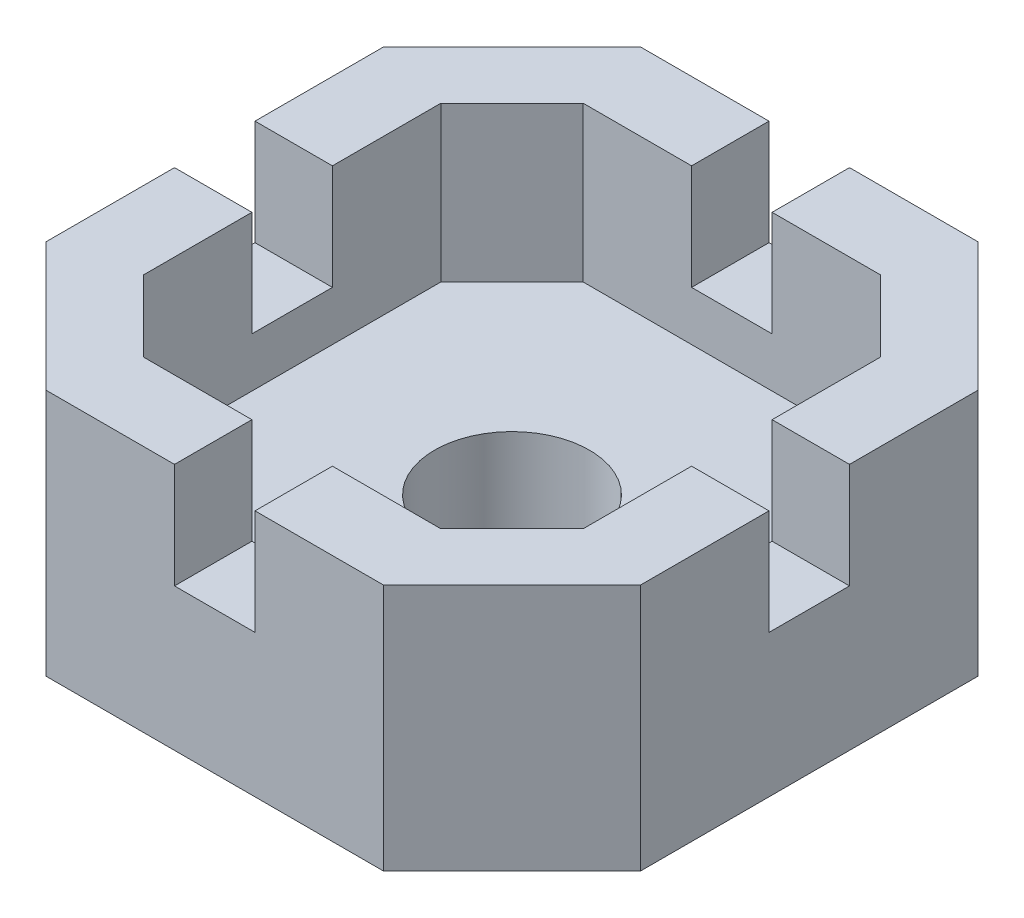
ISO-10303-21;
HEADER;
FILE_DESCRIPTION(('STEP AP214'),'2;1');
FILE_NAME('part.step','',(''),(''),'','','');
FILE_SCHEMA(('AUTOMOTIVE_DESIGN { 1 0 10303 214 1 1 1 1 }'));
ENDSEC;
DATA;
#1=APPLICATION_CONTEXT('core data for automotive mechanical design processes');
#2=APPLICATION_PROTOCOL_DEFINITION('international standard','automotive_design',2000,#1);
#3=PRODUCT_CONTEXT('',#1,'mechanical');
#4=PRODUCT('Part','Part','',(#3));
#5=PRODUCT_RELATED_PRODUCT_CATEGORY('part','',(#4));
#6=PRODUCT_DEFINITION_FORMATION('','',#4);
#7=PRODUCT_DEFINITION_CONTEXT('part definition',#1,'design');
#8=PRODUCT_DEFINITION('design','',#6,#7);
#9=PRODUCT_DEFINITION_SHAPE('','',#8);
#10=(LENGTH_UNIT() NAMED_UNIT(*) SI_UNIT(.MILLI.,.METRE.));
#11=(NAMED_UNIT(*) PLANE_ANGLE_UNIT() SI_UNIT($,.RADIAN.));
#12=(NAMED_UNIT(*) SI_UNIT($,.STERADIAN.) SOLID_ANGLE_UNIT());
#13=UNCERTAINTY_MEASURE_WITH_UNIT(LENGTH_MEASURE(1.E-05),#10,'distance_accuracy_value','');
#14=(GEOMETRIC_REPRESENTATION_CONTEXT(3) GLOBAL_UNCERTAINTY_ASSIGNED_CONTEXT((#13)) GLOBAL_UNIT_ASSIGNED_CONTEXT((#10,
#11,#12)) REPRESENTATION_CONTEXT('',''));
#15=CARTESIAN_POINT('',(0.,0.,0.));
#16=DIRECTION('',(0.,0.,1.));
#17=DIRECTION('',(1.,0.,0.));
#18=AXIS2_PLACEMENT_3D('',#15,#16,#17);
#19=CARTESIAN_POINT('',(0.,6.35,0.));
#20=DIRECTION('',(0.,1.,0.));
#21=DIRECTION('',(0.,0.,1.));
#22=AXIS2_PLACEMENT_3D('',#19,#20,#21);
#23=PLANE('',#22);
#24=DIRECTION('',(1.,0.,0.));
#25=VECTOR('',#24,1.);
#26=CARTESIAN_POINT('',(-12.192,6.35,12.1919999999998));
#27=LINE('',#26,#25);
#28=CARTESIAN_POINT('',(1.651,6.35,12.1919999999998));
#29=VERTEX_POINT('',#28);
#30=CARTESIAN_POINT('',(6.9215,6.35,12.1919999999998));
#31=VERTEX_POINT('',#30);
#32=EDGE_CURVE('E346',#29,#31,#27,.T.);
#33=ORIENTED_EDGE('',*,*,#32,.T.);
#34=DIRECTION('',(0.70710678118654,0.,-0.707106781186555));
#35=VECTOR('',#34,1.);
#36=CARTESIAN_POINT('',(9.55674999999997,6.35,9.55674999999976));
#37=LINE('',#36,#35);
#38=CARTESIAN_POINT('',(12.192,6.35,6.92149999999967));
#39=VERTEX_POINT('',#38);
#40=EDGE_CURVE('E262',#31,#39,#37,.T.);
#41=ORIENTED_EDGE('',*,*,#40,.T.);
#42=DIRECTION('',(0.,0.,-1.));
#43=VECTOR('',#42,1.);
#44=CARTESIAN_POINT('',(12.192,6.35,12.1919999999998));
#45=LINE('',#44,#43);
#46=CARTESIAN_POINT('',(12.192,6.35,1.651));
#47=VERTEX_POINT('',#46);
#48=EDGE_CURVE('E349',#39,#47,#45,.T.);
#49=ORIENTED_EDGE('',*,*,#48,.T.);
#50=DIRECTION('',(-1.,0.,0.));
#51=VECTOR('',#50,1.);
#52=CARTESIAN_POINT('',(0.,6.35,1.651));
#53=LINE('',#52,#51);
#54=CARTESIAN_POINT('',(9.017,6.35,1.651));
#55=VERTEX_POINT('',#54);
#56=EDGE_CURVE('E439',#47,#55,#53,.T.);
#57=ORIENTED_EDGE('',*,*,#56,.T.);
#58=DIRECTION('',(0.,0.,-1.));
#59=VECTOR('',#58,1.);
#60=CARTESIAN_POINT('',(9.017,6.35,-6.096));
#61=LINE('',#60,#59);
#62=CARTESIAN_POINT('',(9.017,6.35,6.096));
#63=VERTEX_POINT('',#62);
#64=EDGE_CURVE('E297',#63,#55,#61,.T.);
#65=ORIENTED_EDGE('',*,*,#64,.F.);
#66=DIRECTION('',(0.70710678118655,0.,-0.707106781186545));
#67=VECTOR('',#66,1.);
#68=CARTESIAN_POINT('',(9.017,6.35,6.096));
#69=LINE('',#68,#67);
#70=CARTESIAN_POINT('',(6.096,6.35,9.01699999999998));
#71=VERTEX_POINT('',#70);
#72=EDGE_CURVE('E294',#71,#63,#69,.T.);
#73=ORIENTED_EDGE('',*,*,#72,.F.);
#74=DIRECTION('',(1.,0.,0.));
#75=VECTOR('',#74,1.);
#76=CARTESIAN_POINT('',(6.096,6.35,9.01699999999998));
#77=LINE('',#76,#75);
#78=CARTESIAN_POINT('',(1.651,6.35,9.0169999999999));
#79=VERTEX_POINT('',#78);
#80=EDGE_CURVE('E290',#79,#71,#77,.T.);
#81=ORIENTED_EDGE('',*,*,#80,.F.);
#82=DIRECTION('',(0.,0.,1.));
#83=VECTOR('',#82,1.);
#84=CARTESIAN_POINT('',(1.651,6.35,0.));
#85=LINE('',#84,#83);
#86=EDGE_CURVE('E403',#79,#29,#85,.T.);
#87=ORIENTED_EDGE('',*,*,#86,.T.);
#88=EDGE_LOOP('',(#33,#41,#49,#57,#65,#73,#81,#87));
#89=FACE_BOUND('',#88,.T.);
#90=ADVANCED_FACE('F39',(#89),#23,.T.);
#91=DIRECTION('',(0.,0.,1.));
#92=VECTOR('',#91,1.);
#93=CARTESIAN_POINT('',(-12.192,6.35,-12.1919999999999));
#94=LINE('',#93,#92);
#95=CARTESIAN_POINT('',(-12.192,6.35,1.651));
#96=VERTEX_POINT('',#95);
#97=CARTESIAN_POINT('',(-12.192,6.35,6.92149999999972));
#98=VERTEX_POINT('',#97);
#99=EDGE_CURVE('E47',#96,#98,#94,.T.);
#100=ORIENTED_EDGE('',*,*,#99,.T.);
#101=DIRECTION('',(0.707106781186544,0.,0.707106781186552));
#102=VECTOR('',#101,1.);
#103=CARTESIAN_POINT('',(-9.55674999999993,6.35,9.55674999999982));
#104=LINE('',#103,#102);
#105=CARTESIAN_POINT('',(-6.92149999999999,6.35,12.1919999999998));
#106=VERTEX_POINT('',#105);
#107=EDGE_CURVE('E253',#98,#106,#104,.T.);
#108=ORIENTED_EDGE('',*,*,#107,.T.);
#109=CARTESIAN_POINT('',(-1.651,6.35,12.1919999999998));
#110=VERTEX_POINT('',#109);
#111=EDGE_CURVE('E261',#106,#110,#27,.T.);
#112=ORIENTED_EDGE('',*,*,#111,.T.);
#113=DIRECTION('',(0.,0.,1.));
#114=VECTOR('',#113,1.);
#115=CARTESIAN_POINT('',(-1.651,6.35,0.));
#116=LINE('',#115,#114);
#117=CARTESIAN_POINT('',(-1.651,6.35,9.01699999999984));
#118=VERTEX_POINT('',#117);
#119=EDGE_CURVE('E412',#118,#110,#116,.T.);
#120=ORIENTED_EDGE('',*,*,#119,.F.);
#121=CARTESIAN_POINT('',(-6.0960000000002,6.35,9.01699999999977));
#122=VERTEX_POINT('',#121);
#123=EDGE_CURVE('E291',#122,#118,#77,.T.);
#124=ORIENTED_EDGE('',*,*,#123,.F.);
#125=DIRECTION('',(0.707106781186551,0.,0.707106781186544));
#126=VECTOR('',#125,1.);
#127=CARTESIAN_POINT('',(-6.0960000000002,6.35,9.01699999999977));
#128=LINE('',#127,#126);
#129=CARTESIAN_POINT('',(-9.017,6.35,6.096));
#130=VERTEX_POINT('',#129);
#131=EDGE_CURVE('E288',#130,#122,#128,.T.);
#132=ORIENTED_EDGE('',*,*,#131,.F.);
#133=DIRECTION('',(0.,0.,1.));
#134=VECTOR('',#133,1.);
#135=CARTESIAN_POINT('',(-9.017,6.35,6.096));
#136=LINE('',#135,#134);
#137=CARTESIAN_POINT('',(-9.017,6.35,1.651));
#138=VERTEX_POINT('',#137);
#139=EDGE_CURVE('E283',#138,#130,#136,.T.);
#140=ORIENTED_EDGE('',*,*,#139,.F.);
#141=DIRECTION('',(-1.,0.,0.));
#142=VECTOR('',#141,1.);
#143=CARTESIAN_POINT('',(0.,6.35,1.651));
#144=LINE('',#143,#142);
#145=EDGE_CURVE('E465',#138,#96,#144,.T.);
#146=ORIENTED_EDGE('',*,*,#145,.T.);
#147=EDGE_LOOP('',(#100,#108,#112,#120,#124,#132,#140,#146));
#148=FACE_BOUND('',#147,.T.);
#149=ADVANCED_FACE('F524',(#148),#23,.T.);
#150=CARTESIAN_POINT('',(12.192,6.35,-1.651));
#151=VERTEX_POINT('',#150);
#152=CARTESIAN_POINT('',(12.192,6.35,-6.92149999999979));
#153=VERTEX_POINT('',#152);
#154=EDGE_CURVE('E348',#151,#153,#45,.T.);
#155=ORIENTED_EDGE('',*,*,#154,.T.);
#156=DIRECTION('',(-0.707106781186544,0.,-0.707106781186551));
#157=VECTOR('',#156,1.);
#158=CARTESIAN_POINT('',(9.55674999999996,6.35,-9.55674999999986));
#159=LINE('',#158,#157);
#160=CARTESIAN_POINT('',(6.92150000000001,6.35,-12.1919999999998));
#161=VERTEX_POINT('',#160);
#162=EDGE_CURVE('E386',#153,#161,#159,.T.);
#163=ORIENTED_EDGE('',*,*,#162,.T.);
#164=DIRECTION('',(-1.,0.,0.));
#165=VECTOR('',#164,1.);
#166=CARTESIAN_POINT('',(12.192,6.35,-12.1919999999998));
#167=LINE('',#166,#165);
#168=CARTESIAN_POINT('',(1.651,6.35,-12.1919999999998));
#169=VERTEX_POINT('',#168);
#170=EDGE_CURVE('E351',#161,#169,#167,.T.);
#171=ORIENTED_EDGE('',*,*,#170,.T.);
#172=DIRECTION('',(0.,0.,1.));
#173=VECTOR('',#172,1.);
#174=CARTESIAN_POINT('',(1.651,6.35,0.));
#175=LINE('',#174,#173);
#176=CARTESIAN_POINT('',(1.651,6.35,-9.01699999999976));
#177=VERTEX_POINT('',#176);
#178=EDGE_CURVE('E483',#169,#177,#175,.T.);
#179=ORIENTED_EDGE('',*,*,#178,.T.);
#180=DIRECTION('',(-1.,0.,0.));
#181=VECTOR('',#180,1.);
#182=CARTESIAN_POINT('',(-6.0960000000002,6.35,-9.01699999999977));
#183=LINE('',#182,#181);
#184=CARTESIAN_POINT('',(6.096,6.35,-9.01699999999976));
#185=VERTEX_POINT('',#184);
#186=EDGE_CURVE('E304',#185,#177,#183,.T.);
#187=ORIENTED_EDGE('',*,*,#186,.F.);
#188=DIRECTION('',(-0.707106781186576,0.,-0.707106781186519));
#189=VECTOR('',#188,1.);
#190=CARTESIAN_POINT('',(6.096,6.35,-9.01699999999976));
#191=LINE('',#190,#189);
#192=CARTESIAN_POINT('',(9.017,6.35,-6.096));
#193=VERTEX_POINT('',#192);
#194=EDGE_CURVE('E300',#193,#185,#191,.T.);
#195=ORIENTED_EDGE('',*,*,#194,.F.);
#196=CARTESIAN_POINT('',(9.017,6.35,-1.651));
#197=VERTEX_POINT('',#196);
#198=EDGE_CURVE('E296',#197,#193,#61,.T.);
#199=ORIENTED_EDGE('',*,*,#198,.F.);
#200=DIRECTION('',(-1.,0.,0.));
#201=VECTOR('',#200,1.);
#202=CARTESIAN_POINT('',(0.,6.35,-1.651));
#203=LINE('',#202,#201);
#204=EDGE_CURVE('E430',#151,#197,#203,.T.);
#205=ORIENTED_EDGE('',*,*,#204,.F.);
#206=EDGE_LOOP('',(#155,#163,#171,#179,#187,#195,#199,#205));
#207=FACE_BOUND('',#206,.T.);
#208=ADVANCED_FACE('F530',(#207),#23,.T.);
#209=CARTESIAN_POINT('',(-1.651,6.35,-12.1919999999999));
#210=VERTEX_POINT('',#209);
#211=CARTESIAN_POINT('',(-6.9215,6.35,-12.1919999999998));
#212=VERTEX_POINT('',#211);
#213=EDGE_CURVE('E350',#210,#212,#167,.T.);
#214=ORIENTED_EDGE('',*,*,#213,.T.);
#215=DIRECTION('',(-0.707106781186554,0.,0.707106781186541));
#216=VECTOR('',#215,1.);
#217=CARTESIAN_POINT('',(-9.55674999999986,6.35,-9.55675000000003));
#218=LINE('',#217,#216);
#219=CARTESIAN_POINT('',(-12.192,6.35,-6.92149999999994));
#220=VERTEX_POINT('',#219);
#221=EDGE_CURVE('E364',#212,#220,#218,.T.);
#222=ORIENTED_EDGE('',*,*,#221,.T.);
#223=CARTESIAN_POINT('',(-12.192,6.35,-1.651));
#224=VERTEX_POINT('',#223);
#225=EDGE_CURVE('E11',#220,#224,#94,.T.);
#226=ORIENTED_EDGE('',*,*,#225,.T.);
#227=DIRECTION('',(-1.,0.,0.));
#228=VECTOR('',#227,1.);
#229=CARTESIAN_POINT('',(0.,6.35,-1.651));
#230=LINE('',#229,#228);
#231=CARTESIAN_POINT('',(-9.017,6.35,-1.651));
#232=VERTEX_POINT('',#231);
#233=EDGE_CURVE('E455',#232,#224,#230,.T.);
#234=ORIENTED_EDGE('',*,*,#233,.F.);
#235=CARTESIAN_POINT('',(-9.017,6.35,-6.096));
#236=VERTEX_POINT('',#235);
#237=EDGE_CURVE('E285',#236,#232,#136,.T.);
#238=ORIENTED_EDGE('',*,*,#237,.F.);
#239=DIRECTION('',(-0.707106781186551,0.,0.707106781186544));
#240=VECTOR('',#239,1.);
#241=CARTESIAN_POINT('',(-9.017,6.35,-6.096));
#242=LINE('',#241,#240);
#243=CARTESIAN_POINT('',(-6.0960000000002,6.35,-9.01699999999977));
#244=VERTEX_POINT('',#243);
#245=EDGE_CURVE('E281',#244,#236,#242,.T.);
#246=ORIENTED_EDGE('',*,*,#245,.F.);
#247=CARTESIAN_POINT('',(-1.651,6.35,-9.01699999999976));
#248=VERTEX_POINT('',#247);
#249=EDGE_CURVE('E303',#248,#244,#183,.T.);
#250=ORIENTED_EDGE('',*,*,#249,.F.);
#251=DIRECTION('',(0.,0.,1.));
#252=VECTOR('',#251,1.);
#253=CARTESIAN_POINT('',(-1.651,6.35,0.));
#254=LINE('',#253,#252);
#255=EDGE_CURVE('E367',#210,#248,#254,.T.);
#256=ORIENTED_EDGE('',*,*,#255,.F.);
#257=EDGE_LOOP('',(#214,#222,#226,#234,#238,#246,#250,#256));
#258=FACE_BOUND('',#257,.T.);
#259=ADVANCED_FACE('F363',(#258),#23,.T.);
#260=CARTESIAN_POINT('',(-12.192,6.35,12.1919999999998));
#261=DIRECTION('',(0.,0.,-1.));
#262=DIRECTION('',(-1.,0.,0.));
#263=AXIS2_PLACEMENT_3D('',#260,#261,#262);
#264=PLANE('',#263);
#265=DIRECTION('',(0.,1.,0.));
#266=VECTOR('',#265,1.);
#267=CARTESIAN_POINT('',(-6.92149999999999,-3.81,12.1919999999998));
#268=LINE('',#267,#266);
#269=CARTESIAN_POINT('',(-6.92149999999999,-3.81,12.1919999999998));
#270=VERTEX_POINT('',#269);
#271=EDGE_CURVE('E247',#270,#106,#268,.T.);
#272=ORIENTED_EDGE('',*,*,#271,.F.);
#273=DIRECTION('',(-1.,0.,0.));
#274=VECTOR('',#273,1.);
#275=CARTESIAN_POINT('',(12.192,-3.81,12.1919999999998));
#276=LINE('',#275,#274);
#277=CARTESIAN_POINT('',(6.9215,-3.81,12.1919999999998));
#278=VERTEX_POINT('',#277);
#279=EDGE_CURVE('E259',#278,#270,#276,.T.);
#280=ORIENTED_EDGE('',*,*,#279,.F.);
#281=DIRECTION('',(0.,1.,0.));
#282=VECTOR('',#281,1.);
#283=CARTESIAN_POINT('',(6.9215,-3.81,12.1919999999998));
#284=LINE('',#283,#282);
#285=EDGE_CURVE('E396',#278,#31,#284,.T.);
#286=ORIENTED_EDGE('',*,*,#285,.T.);
#287=ORIENTED_EDGE('',*,*,#32,.F.);
#288=DIRECTION('',(0.,1.,0.));
#289=VECTOR('',#288,1.);
#290=CARTESIAN_POINT('',(1.651,2.032,12.1919999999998));
#291=LINE('',#290,#289);
#292=CARTESIAN_POINT('',(1.651,2.032,12.1919999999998));
#293=VERTEX_POINT('',#292);
#294=EDGE_CURVE('E422',#293,#29,#291,.T.);
#295=ORIENTED_EDGE('',*,*,#294,.F.);
#296=DIRECTION('',(1.,0.,0.));
#297=VECTOR('',#296,1.);
#298=CARTESIAN_POINT('',(0.,2.032,12.1919999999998));
#299=LINE('',#298,#297);
#300=CARTESIAN_POINT('',(-1.651,2.032,12.1919999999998));
#301=VERTEX_POINT('',#300);
#302=EDGE_CURVE('E406',#301,#293,#299,.T.);
#303=ORIENTED_EDGE('',*,*,#302,.F.);
#304=DIRECTION('',(0.,1.,0.));
#305=VECTOR('',#304,1.);
#306=CARTESIAN_POINT('',(-1.651,2.032,12.1919999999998));
#307=LINE('',#306,#305);
#308=EDGE_CURVE('E424',#301,#110,#307,.T.);
#309=ORIENTED_EDGE('',*,*,#308,.T.);
#310=ORIENTED_EDGE('',*,*,#111,.F.);
#311=EDGE_LOOP('',(#272,#280,#286,#287,#295,#303,#309,#310));
#312=FACE_BOUND('',#311,.T.);
#313=ADVANCED_FACE('F41',(#312),#264,.F.);
#314=CARTESIAN_POINT('',(12.192,6.35,12.1919999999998));
#315=DIRECTION('',(-1.,0.,0.));
#316=DIRECTION('',(0.,0.,1.));
#317=AXIS2_PLACEMENT_3D('',#314,#315,#316);
#318=PLANE('',#317);
#319=DIRECTION('',(0.,1.,0.));
#320=VECTOR('',#319,1.);
#321=CARTESIAN_POINT('',(12.192,-3.81,-6.92149999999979));
#322=LINE('',#321,#320);
#323=CARTESIAN_POINT('',(12.192,-3.81,-6.92149999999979));
#324=VERTEX_POINT('',#323);
#325=EDGE_CURVE('E388',#324,#153,#322,.T.);
#326=ORIENTED_EDGE('',*,*,#325,.T.);
#327=ORIENTED_EDGE('',*,*,#154,.F.);
#328=DIRECTION('',(0.,1.,0.));
#329=VECTOR('',#328,1.);
#330=CARTESIAN_POINT('',(12.192,2.032,-1.651));
#331=LINE('',#330,#329);
#332=CARTESIAN_POINT('',(12.192,2.032,-1.651));
#333=VERTEX_POINT('',#332);
#334=EDGE_CURVE('E448',#333,#151,#331,.T.);
#335=ORIENTED_EDGE('',*,*,#334,.F.);
#336=DIRECTION('',(0.,0.,-1.));
#337=VECTOR('',#336,1.);
#338=CARTESIAN_POINT('',(12.192,2.032,0.));
#339=LINE('',#338,#337);
#340=CARTESIAN_POINT('',(12.192,2.032,1.651));
#341=VERTEX_POINT('',#340);
#342=EDGE_CURVE('E429',#341,#333,#339,.T.);
#343=ORIENTED_EDGE('',*,*,#342,.F.);
#344=DIRECTION('',(0.,1.,0.));
#345=VECTOR('',#344,1.);
#346=CARTESIAN_POINT('',(12.192,2.032,1.651));
#347=LINE('',#346,#345);
#348=EDGE_CURVE('E438',#341,#47,#347,.T.);
#349=ORIENTED_EDGE('',*,*,#348,.T.);
#350=ORIENTED_EDGE('',*,*,#48,.F.);
#351=DIRECTION('',(0.,1.,0.));
#352=VECTOR('',#351,1.);
#353=CARTESIAN_POINT('',(12.192,-3.81,6.92149999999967));
#354=LINE('',#353,#352);
#355=CARTESIAN_POINT('',(12.192,-3.81,6.92149999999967));
#356=VERTEX_POINT('',#355);
#357=EDGE_CURVE('E393',#356,#39,#354,.T.);
#358=ORIENTED_EDGE('',*,*,#357,.F.);
#359=DIRECTION('',(0.,0.,1.));
#360=VECTOR('',#359,1.);
#361=CARTESIAN_POINT('',(12.192,-3.81,12.1919999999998));
#362=LINE('',#361,#360);
#363=EDGE_CURVE('E270',#324,#356,#362,.T.);
#364=ORIENTED_EDGE('',*,*,#363,.F.);
#365=EDGE_LOOP('',(#326,#327,#335,#343,#349,#350,#358,#364));
#366=FACE_BOUND('',#365,.T.);
#367=ADVANCED_FACE('F540',(#366),#318,.F.);
#368=CARTESIAN_POINT('',(12.192,6.35,-12.1919999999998));
#369=DIRECTION('',(0.,0.,1.));
#370=DIRECTION('',(1.,0.,0.));
#371=AXIS2_PLACEMENT_3D('',#368,#369,#370);
#372=PLANE('',#371);
#373=DIRECTION('',(0.,1.,0.));
#374=VECTOR('',#373,1.);
#375=CARTESIAN_POINT('',(6.92150000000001,-3.81,-12.1919999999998));
#376=LINE('',#375,#374);
#377=CARTESIAN_POINT('',(6.92150000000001,-3.81,-12.1919999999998));
#378=VERTEX_POINT('',#377);
#379=EDGE_CURVE('E385',#378,#161,#376,.T.);
#380=ORIENTED_EDGE('',*,*,#379,.F.);
#381=DIRECTION('',(1.,0.,0.));
#382=VECTOR('',#381,1.);
#383=CARTESIAN_POINT('',(12.192,-3.81,-12.1919999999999));
#384=LINE('',#383,#382);
#385=CARTESIAN_POINT('',(-6.92149999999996,-3.81,-12.1919999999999));
#386=VERTEX_POINT('',#385);
#387=EDGE_CURVE('E272',#386,#378,#384,.T.);
#388=ORIENTED_EDGE('',*,*,#387,.F.);
#389=DIRECTION('',(0.,1.,0.));
#390=VECTOR('',#389,1.);
#391=CARTESIAN_POINT('',(-6.9215,-3.81,-12.1919999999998));
#392=LINE('',#391,#390);
#393=EDGE_CURVE('E54',#386,#212,#392,.T.);
#394=ORIENTED_EDGE('',*,*,#393,.T.);
#395=ORIENTED_EDGE('',*,*,#213,.F.);
#396=DIRECTION('',(0.,1.,0.));
#397=VECTOR('',#396,1.);
#398=CARTESIAN_POINT('',(-1.651,2.032,-12.1919999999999));
#399=LINE('',#398,#397);
#400=CARTESIAN_POINT('',(-1.651,2.032,-12.1919999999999));
#401=VERTEX_POINT('',#400);
#402=EDGE_CURVE('E373',#401,#210,#399,.T.);
#403=ORIENTED_EDGE('',*,*,#402,.F.);
#404=DIRECTION('',(-1.,0.,0.));
#405=VECTOR('',#404,1.);
#406=CARTESIAN_POINT('',(0.,2.032,-12.1919999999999));
#407=LINE('',#406,#405);
#408=CARTESIAN_POINT('',(1.651,2.032,-12.1919999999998));
#409=VERTEX_POINT('',#408);
#410=EDGE_CURVE('E479',#409,#401,#407,.T.);
#411=ORIENTED_EDGE('',*,*,#410,.F.);
#412=DIRECTION('',(0.,1.,0.));
#413=VECTOR('',#412,1.);
#414=CARTESIAN_POINT('',(1.651,2.032,-12.1919999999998));
#415=LINE('',#414,#413);
#416=EDGE_CURVE('E468',#409,#169,#415,.T.);
#417=ORIENTED_EDGE('',*,*,#416,.T.);
#418=ORIENTED_EDGE('',*,*,#170,.F.);
#419=EDGE_LOOP('',(#380,#388,#394,#395,#403,#411,#417,#418));
#420=FACE_BOUND('',#419,.T.);
#421=ADVANCED_FACE('F371',(#420),#372,.F.);
#422=CARTESIAN_POINT('',(-12.192,6.35,-12.1919999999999));
#423=DIRECTION('',(1.,0.,0.));
#424=DIRECTION('',(0.,0.,-1.));
#425=AXIS2_PLACEMENT_3D('',#422,#423,#424);
#426=PLANE('',#425);
#427=DIRECTION('',(0.,1.,0.));
#428=VECTOR('',#427,1.);
#429=CARTESIAN_POINT('',(-12.192,-3.81,-6.92149999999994));
#430=LINE('',#429,#428);
#431=CARTESIAN_POINT('',(-12.192,-3.81,-6.92149999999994));
#432=VERTEX_POINT('',#431);
#433=EDGE_CURVE('E375',#432,#220,#430,.T.);
#434=ORIENTED_EDGE('',*,*,#433,.F.);
#435=DIRECTION('',(0.,0.,-1.));
#436=VECTOR('',#435,1.);
#437=CARTESIAN_POINT('',(-12.192,-3.81,12.1919999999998));
#438=LINE('',#437,#436);
#439=CARTESIAN_POINT('',(-12.192,-3.81,6.92149999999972));
#440=VERTEX_POINT('',#439);
#441=EDGE_CURVE('E269',#440,#432,#438,.T.);
#442=ORIENTED_EDGE('',*,*,#441,.F.);
#443=DIRECTION('',(0.,1.,0.));
#444=VECTOR('',#443,1.);
#445=CARTESIAN_POINT('',(-12.192,-3.81,6.92149999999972));
#446=LINE('',#445,#444);
#447=EDGE_CURVE('E62',#440,#98,#446,.T.);
#448=ORIENTED_EDGE('',*,*,#447,.T.);
#449=ORIENTED_EDGE('',*,*,#99,.F.);
#450=DIRECTION('',(0.,1.,0.));
#451=VECTOR('',#450,1.);
#452=CARTESIAN_POINT('',(-12.192,2.032,1.651));
#453=LINE('',#452,#451);
#454=CARTESIAN_POINT('',(-12.192,2.032,1.651));
#455=VERTEX_POINT('',#454);
#456=EDGE_CURVE('E442',#455,#96,#453,.T.);
#457=ORIENTED_EDGE('',*,*,#456,.F.);
#458=DIRECTION('',(0.,0.,1.));
#459=VECTOR('',#458,1.);
#460=CARTESIAN_POINT('',(-12.192,2.032,0.));
#461=LINE('',#460,#459);
#462=CARTESIAN_POINT('',(-12.192,2.032,-1.651));
#463=VERTEX_POINT('',#462);
#464=EDGE_CURVE('E461',#463,#455,#461,.T.);
#465=ORIENTED_EDGE('',*,*,#464,.F.);
#466=DIRECTION('',(0.,1.,0.));
#467=VECTOR('',#466,1.);
#468=CARTESIAN_POINT('',(-12.192,2.032,-1.651));
#469=LINE('',#468,#467);
#470=EDGE_CURVE('E472',#463,#224,#469,.T.);
#471=ORIENTED_EDGE('',*,*,#470,.T.);
#472=ORIENTED_EDGE('',*,*,#225,.F.);
#473=EDGE_LOOP('',(#434,#442,#448,#449,#457,#465,#471,#472));
#474=FACE_BOUND('',#473,.T.);
#475=ADVANCED_FACE('F558',(#474),#426,.F.);
#476=CARTESIAN_POINT('',(0.,-3.81,0.));
#477=DIRECTION('',(0.,1.,0.));
#478=DIRECTION('',(0.,0.,1.));
#479=AXIS2_PLACEMENT_3D('',#476,#477,#478);
#480=PLANE('',#479);
#481=CARTESIAN_POINT('',(0.,-3.81,0.));
#482=DIRECTION('',(0.,-1.,0.));
#483=DIRECTION('',(0.,0.,-1.));
#484=AXIS2_PLACEMENT_3D('',#481,#482,#483);
#485=CIRCLE('',#484,3.175);
#486=CARTESIAN_POINT('',(0.,-3.81,3.17499999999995));
#487=VERTEX_POINT('',#486);
#488=EDGE_CURVE('E274',#487,#487,#485,.T.);
#489=ORIENTED_EDGE('',*,*,#488,.F.);
#490=EDGE_LOOP('',(#489));
#491=FACE_BOUND('',#490,.T.);
#492=DIRECTION('',(-0.707106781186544,0.,-0.707106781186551));
#493=VECTOR('',#492,1.);
#494=CARTESIAN_POINT('',(9.55674999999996,-3.81,-9.55674999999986));
#495=LINE('',#494,#493);
#496=EDGE_CURVE('E383',#324,#378,#495,.T.);
#497=ORIENTED_EDGE('',*,*,#496,.F.);
#498=ORIENTED_EDGE('',*,*,#363,.T.);
#499=DIRECTION('',(0.70710678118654,0.,-0.707106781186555));
#500=VECTOR('',#499,1.);
#501=CARTESIAN_POINT('',(9.55674999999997,-3.81,9.55674999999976));
#502=LINE('',#501,#500);
#503=EDGE_CURVE('E268',#278,#356,#502,.T.);
#504=ORIENTED_EDGE('',*,*,#503,.F.);
#505=ORIENTED_EDGE('',*,*,#279,.T.);
#506=DIRECTION('',(0.707106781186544,0.,0.707106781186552));
#507=VECTOR('',#506,1.);
#508=CARTESIAN_POINT('',(-9.55674999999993,-3.81,9.55674999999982));
#509=LINE('',#508,#507);
#510=EDGE_CURVE('E244',#440,#270,#509,.T.);
#511=ORIENTED_EDGE('',*,*,#510,.F.);
#512=ORIENTED_EDGE('',*,*,#441,.T.);
#513=DIRECTION('',(-0.707106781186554,0.,0.707106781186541));
#514=VECTOR('',#513,1.);
#515=CARTESIAN_POINT('',(-9.55674999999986,-3.81,-9.55675000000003));
#516=LINE('',#515,#514);
#517=EDGE_CURVE('E378',#386,#432,#516,.T.);
#518=ORIENTED_EDGE('',*,*,#517,.F.);
#519=ORIENTED_EDGE('',*,*,#387,.T.);
#520=EDGE_LOOP('',(#497,#498,#504,#505,#511,#512,#518,#519));
#521=FACE_BOUND('',#520,.T.);
#522=ADVANCED_FACE('F266',(#491,#521),#480,.F.);
#523=CARTESIAN_POINT('',(-9.017,6.35,6.096));
#524=DIRECTION('',(1.,0.,0.));
#525=DIRECTION('',(0.,0.,-1.));
#526=AXIS2_PLACEMENT_3D('',#523,#524,#525);
#527=PLANE('',#526);
#528=DIRECTION('',(0.,0.,-1.));
#529=VECTOR('',#528,1.);
#530=CARTESIAN_POINT('',(-9.017,2.032,0.));
#531=LINE('',#530,#529);
#532=CARTESIAN_POINT('',(-9.017,2.032,1.651));
#533=VERTEX_POINT('',#532);
#534=CARTESIAN_POINT('',(-9.017,2.032,-1.651));
#535=VERTEX_POINT('',#534);
#536=EDGE_CURVE('E454',#533,#535,#531,.T.);
#537=ORIENTED_EDGE('',*,*,#536,.F.);
#538=DIRECTION('',(0.,1.,0.));
#539=VECTOR('',#538,1.);
#540=CARTESIAN_POINT('',(-9.017,2.032,1.651));
#541=LINE('',#540,#539);
#542=EDGE_CURVE('E464',#533,#138,#541,.T.);
#543=ORIENTED_EDGE('',*,*,#542,.T.);
#544=ORIENTED_EDGE('',*,*,#139,.T.);
#545=DIRECTION('',(0.,-1.,0.));
#546=VECTOR('',#545,1.);
#547=CARTESIAN_POINT('',(-9.017,6.35,6.096));
#548=LINE('',#547,#546);
#549=CARTESIAN_POINT('',(-9.017,0.,6.096));
#550=VERTEX_POINT('',#549);
#551=EDGE_CURVE('E341',#130,#550,#548,.T.);
#552=ORIENTED_EDGE('',*,*,#551,.T.);
#553=DIRECTION('',(0.,0.,1.));
#554=VECTOR('',#553,1.);
#555=CARTESIAN_POINT('',(-9.017,0.,6.096));
#556=LINE('',#555,#554);
#557=CARTESIAN_POINT('',(-9.017,0.,-6.096));
#558=VERTEX_POINT('',#557);
#559=EDGE_CURVE('E310',#558,#550,#556,.T.);
#560=ORIENTED_EDGE('',*,*,#559,.F.);
#561=DIRECTION('',(0.,-1.,0.));
#562=VECTOR('',#561,1.);
#563=CARTESIAN_POINT('',(-9.017,6.35,-6.096));
#564=LINE('',#563,#562);
#565=EDGE_CURVE('E343',#236,#558,#564,.T.);
#566=ORIENTED_EDGE('',*,*,#565,.F.);
#567=ORIENTED_EDGE('',*,*,#237,.T.);
#568=DIRECTION('',(0.,1.,0.));
#569=VECTOR('',#568,1.);
#570=CARTESIAN_POINT('',(-9.017,2.032,-1.651));
#571=LINE('',#570,#569);
#572=EDGE_CURVE('E475',#535,#232,#571,.T.);
#573=ORIENTED_EDGE('',*,*,#572,.F.);
#574=EDGE_LOOP('',(#537,#543,#544,#552,#560,#566,#567,#573));
#575=FACE_BOUND('',#574,.T.);
#576=ADVANCED_FACE('F567',(#575),#527,.T.);
#577=CARTESIAN_POINT('',(6.096,6.35,9.01699999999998));
#578=DIRECTION('',(0.,0.,-1.));
#579=DIRECTION('',(-1.,0.,0.));
#580=AXIS2_PLACEMENT_3D('',#577,#578,#579);
#581=PLANE('',#580);
#582=DIRECTION('',(-1.,0.,0.));
#583=VECTOR('',#582,1.);
#584=CARTESIAN_POINT('',(-1.53956708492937E-13,2.032,9.01699999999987));
#585=LINE('',#584,#583);
#586=CARTESIAN_POINT('',(1.651,2.032,9.0169999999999));
#587=VERTEX_POINT('',#586);
#588=CARTESIAN_POINT('',(-1.651,2.032,9.01699999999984));
#589=VERTEX_POINT('',#588);
#590=EDGE_CURVE('E399',#587,#589,#585,.T.);
#591=ORIENTED_EDGE('',*,*,#590,.F.);
#592=DIRECTION('',(0.,1.,0.));
#593=VECTOR('',#592,1.);
#594=CARTESIAN_POINT('',(1.651,2.032,9.0169999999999));
#595=LINE('',#594,#593);
#596=EDGE_CURVE('E418',#587,#79,#595,.T.);
#597=ORIENTED_EDGE('',*,*,#596,.T.);
#598=ORIENTED_EDGE('',*,*,#80,.T.);
#599=DIRECTION('',(0.,-1.,0.));
#600=VECTOR('',#599,1.);
#601=CARTESIAN_POINT('',(6.096,6.35,9.01699999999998));
#602=LINE('',#601,#600);
#603=CARTESIAN_POINT('',(6.096,0.,9.01699999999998));
#604=VERTEX_POINT('',#603);
#605=EDGE_CURVE('E337',#71,#604,#602,.T.);
#606=ORIENTED_EDGE('',*,*,#605,.T.);
#607=DIRECTION('',(1.,0.,0.));
#608=VECTOR('',#607,1.);
#609=CARTESIAN_POINT('',(6.096,0.,9.01699999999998));
#610=LINE('',#609,#608);
#611=CARTESIAN_POINT('',(-6.0960000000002,0.,9.01699999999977));
#612=VERTEX_POINT('',#611);
#613=EDGE_CURVE('E316',#612,#604,#610,.T.);
#614=ORIENTED_EDGE('',*,*,#613,.F.);
#615=DIRECTION('',(0.,-1.,0.));
#616=VECTOR('',#615,1.);
#617=CARTESIAN_POINT('',(-6.0960000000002,6.35,9.01699999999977));
#618=LINE('',#617,#616);
#619=EDGE_CURVE('E339',#122,#612,#618,.T.);
#620=ORIENTED_EDGE('',*,*,#619,.F.);
#621=ORIENTED_EDGE('',*,*,#123,.T.);
#622=DIRECTION('',(0.,1.,0.));
#623=VECTOR('',#622,1.);
#624=CARTESIAN_POINT('',(-1.651,2.032,9.01699999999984));
#625=LINE('',#624,#623);
#626=EDGE_CURVE('E411',#589,#118,#625,.T.);
#627=ORIENTED_EDGE('',*,*,#626,.F.);
#628=EDGE_LOOP('',(#591,#597,#598,#606,#614,#620,#621,#627));
#629=FACE_BOUND('',#628,.T.);
#630=ADVANCED_FACE('F624',(#629),#581,.T.);
#631=CARTESIAN_POINT('',(9.017,6.35,-6.096));
#632=DIRECTION('',(-1.,0.,0.));
#633=DIRECTION('',(0.,0.,1.));
#634=AXIS2_PLACEMENT_3D('',#631,#632,#633);
#635=PLANE('',#634);
#636=ORIENTED_EDGE('',*,*,#64,.T.);
#637=DIRECTION('',(0.,1.,0.));
#638=VECTOR('',#637,1.);
#639=CARTESIAN_POINT('',(9.017,2.032,1.651));
#640=LINE('',#639,#638);
#641=CARTESIAN_POINT('',(9.017,2.032,1.651));
#642=VERTEX_POINT('',#641);
#643=EDGE_CURVE('E415',#642,#55,#640,.T.);
#644=ORIENTED_EDGE('',*,*,#643,.F.);
#645=DIRECTION('',(0.,0.,1.));
#646=VECTOR('',#645,1.);
#647=CARTESIAN_POINT('',(9.017,2.032,0.));
#648=LINE('',#647,#646);
#649=CARTESIAN_POINT('',(9.017,2.032,-1.651));
#650=VERTEX_POINT('',#649);
#651=EDGE_CURVE('E435',#650,#642,#648,.T.);
#652=ORIENTED_EDGE('',*,*,#651,.F.);
#653=DIRECTION('',(0.,1.,0.));
#654=VECTOR('',#653,1.);
#655=CARTESIAN_POINT('',(9.017,2.032,-1.651));
#656=LINE('',#655,#654);
#657=EDGE_CURVE('E445',#650,#197,#656,.T.);
#658=ORIENTED_EDGE('',*,*,#657,.T.);
#659=ORIENTED_EDGE('',*,*,#198,.T.);
#660=DIRECTION('',(0.,-1.,0.));
#661=VECTOR('',#660,1.);
#662=CARTESIAN_POINT('',(9.017,6.35,-6.096));
#663=LINE('',#662,#661);
#664=CARTESIAN_POINT('',(9.017,0.,-6.096));
#665=VERTEX_POINT('',#664);
#666=EDGE_CURVE('E333',#193,#665,#663,.T.);
#667=ORIENTED_EDGE('',*,*,#666,.T.);
#668=DIRECTION('',(0.,0.,-1.));
#669=VECTOR('',#668,1.);
#670=CARTESIAN_POINT('',(9.017,0.,-6.096));
#671=LINE('',#670,#669);
#672=CARTESIAN_POINT('',(9.017,0.,6.096));
#673=VERTEX_POINT('',#672);
#674=EDGE_CURVE('E322',#673,#665,#671,.T.);
#675=ORIENTED_EDGE('',*,*,#674,.F.);
#676=DIRECTION('',(0.,-1.,0.));
#677=VECTOR('',#676,1.);
#678=CARTESIAN_POINT('',(9.017,6.35,6.096));
#679=LINE('',#678,#677);
#680=EDGE_CURVE('E335',#63,#673,#679,.T.);
#681=ORIENTED_EDGE('',*,*,#680,.F.);
#682=EDGE_LOOP('',(#636,#644,#652,#658,#659,#667,#675,#681));
#683=FACE_BOUND('',#682,.T.);
#684=ADVANCED_FACE('F600',(#683),#635,.T.);
#685=CARTESIAN_POINT('',(-6.0960000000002,6.35,-9.01699999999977));
#686=DIRECTION('',(0.,0.,1.));
#687=DIRECTION('',(1.,0.,0.));
#688=AXIS2_PLACEMENT_3D('',#685,#686,#687);
#689=PLANE('',#688);
#690=ORIENTED_EDGE('',*,*,#186,.T.);
#691=DIRECTION('',(0.,1.,0.));
#692=VECTOR('',#691,1.);
#693=CARTESIAN_POINT('',(1.651,2.032,-9.01699999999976));
#694=LINE('',#693,#692);
#695=CARTESIAN_POINT('',(1.651,2.032,-9.01699999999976));
#696=VERTEX_POINT('',#695);
#697=EDGE_CURVE('E494',#696,#177,#694,.T.);
#698=ORIENTED_EDGE('',*,*,#697,.F.);
#699=DIRECTION('',(1.,0.,0.));
#700=VECTOR('',#699,1.);
#701=CARTESIAN_POINT('',(0.,2.032,-9.01699999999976));
#702=LINE('',#701,#700);
#703=CARTESIAN_POINT('',(-1.651,2.032,-9.01699999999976));
#704=VERTEX_POINT('',#703);
#705=EDGE_CURVE('E485',#704,#696,#702,.T.);
#706=ORIENTED_EDGE('',*,*,#705,.F.);
#707=DIRECTION('',(0.,1.,0.));
#708=VECTOR('',#707,1.);
#709=CARTESIAN_POINT('',(-1.651,2.032,-9.01699999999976));
#710=LINE('',#709,#708);
#711=EDGE_CURVE('E496',#704,#248,#710,.T.);
#712=ORIENTED_EDGE('',*,*,#711,.T.);
#713=ORIENTED_EDGE('',*,*,#249,.T.);
#714=DIRECTION('',(0.,-1.,0.));
#715=VECTOR('',#714,1.);
#716=CARTESIAN_POINT('',(-6.0960000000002,6.35,-9.01699999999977));
#717=LINE('',#716,#715);
#718=CARTESIAN_POINT('',(-6.0960000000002,0.,-9.01699999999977));
#719=VERTEX_POINT('',#718);
#720=EDGE_CURVE('E307',#244,#719,#717,.T.);
#721=ORIENTED_EDGE('',*,*,#720,.T.);
#722=DIRECTION('',(-1.,0.,0.));
#723=VECTOR('',#722,1.);
#724=CARTESIAN_POINT('',(-6.0960000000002,0.,-9.01699999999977));
#725=LINE('',#724,#723);
#726=CARTESIAN_POINT('',(6.096,0.,-9.01699999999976));
#727=VERTEX_POINT('',#726);
#728=EDGE_CURVE('E284',#727,#719,#725,.T.);
#729=ORIENTED_EDGE('',*,*,#728,.F.);
#730=DIRECTION('',(0.,-1.,0.));
#731=VECTOR('',#730,1.);
#732=CARTESIAN_POINT('',(6.096,6.35,-9.01699999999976));
#733=LINE('',#732,#731);
#734=EDGE_CURVE('E331',#185,#727,#733,.T.);
#735=ORIENTED_EDGE('',*,*,#734,.F.);
#736=EDGE_LOOP('',(#690,#698,#706,#712,#713,#721,#729,#735));
#737=FACE_BOUND('',#736,.T.);
#738=ADVANCED_FACE('F586',(#737),#689,.T.);
#739=CARTESIAN_POINT('',(-9.017,6.35,-6.096));
#740=DIRECTION('',(0.707106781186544,0.,0.707106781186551));
#741=DIRECTION('',(0.707106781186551,0.,-0.707106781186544));
#742=AXIS2_PLACEMENT_3D('',#739,#740,#741);
#743=PLANE('',#742);
#744=DIRECTION('',(-0.707106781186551,0.,0.707106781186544));
#745=VECTOR('',#744,1.);
#746=CARTESIAN_POINT('',(-9.017,0.,-6.096));
#747=LINE('',#746,#745);
#748=EDGE_CURVE('E280',#719,#558,#747,.T.);
#749=ORIENTED_EDGE('',*,*,#748,.F.);
#750=ORIENTED_EDGE('',*,*,#720,.F.);
#751=ORIENTED_EDGE('',*,*,#245,.T.);
#752=ORIENTED_EDGE('',*,*,#565,.T.);
#753=EDGE_LOOP('',(#749,#750,#751,#752));
#754=FACE_BOUND('',#753,.T.);
#755=ADVANCED_FACE('F581',(#754),#743,.T.);
#756=CARTESIAN_POINT('',(-6.0960000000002,6.35,9.01699999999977));
#757=DIRECTION('',(0.707106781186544,0.,-0.707106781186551));
#758=DIRECTION('',(-0.707106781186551,0.,-0.707106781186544));
#759=AXIS2_PLACEMENT_3D('',#756,#757,#758);
#760=PLANE('',#759);
#761=DIRECTION('',(0.707106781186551,0.,0.707106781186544));
#762=VECTOR('',#761,1.);
#763=CARTESIAN_POINT('',(-6.0960000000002,0.,9.01699999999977));
#764=LINE('',#763,#762);
#765=EDGE_CURVE('E313',#550,#612,#764,.T.);
#766=ORIENTED_EDGE('',*,*,#765,.F.);
#767=ORIENTED_EDGE('',*,*,#551,.F.);
#768=ORIENTED_EDGE('',*,*,#131,.T.);
#769=ORIENTED_EDGE('',*,*,#619,.T.);
#770=EDGE_LOOP('',(#766,#767,#768,#769));
#771=FACE_BOUND('',#770,.T.);
#772=ADVANCED_FACE('F826',(#771),#760,.T.);
#773=CARTESIAN_POINT('',(9.017,6.35,6.096));
#774=DIRECTION('',(-0.707106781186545,0.,-0.70710678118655));
#775=DIRECTION('',(-0.70710678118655,0.,0.707106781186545));
#776=AXIS2_PLACEMENT_3D('',#773,#774,#775);
#777=PLANE('',#776);
#778=DIRECTION('',(0.70710678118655,0.,-0.707106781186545));
#779=VECTOR('',#778,1.);
#780=CARTESIAN_POINT('',(9.017,0.,6.096));
#781=LINE('',#780,#779);
#782=EDGE_CURVE('E319',#604,#673,#781,.T.);
#783=ORIENTED_EDGE('',*,*,#782,.F.);
#784=ORIENTED_EDGE('',*,*,#605,.F.);
#785=ORIENTED_EDGE('',*,*,#72,.T.);
#786=ORIENTED_EDGE('',*,*,#680,.T.);
#787=EDGE_LOOP('',(#783,#784,#785,#786));
#788=FACE_BOUND('',#787,.T.);
#789=ADVANCED_FACE('F618',(#788),#777,.T.);
#790=CARTESIAN_POINT('',(6.096,6.35,-9.01699999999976));
#791=DIRECTION('',(-0.707106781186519,0.,0.707106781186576));
#792=DIRECTION('',(0.707106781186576,0.,0.707106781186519));
#793=AXIS2_PLACEMENT_3D('',#790,#791,#792);
#794=PLANE('',#793);
#795=DIRECTION('',(-0.707106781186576,0.,-0.707106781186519));
#796=VECTOR('',#795,1.);
#797=CARTESIAN_POINT('',(6.096,0.,-9.01699999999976));
#798=LINE('',#797,#796);
#799=EDGE_CURVE('E325',#665,#727,#798,.T.);
#800=ORIENTED_EDGE('',*,*,#799,.F.);
#801=ORIENTED_EDGE('',*,*,#666,.F.);
#802=ORIENTED_EDGE('',*,*,#194,.T.);
#803=ORIENTED_EDGE('',*,*,#734,.T.);
#804=EDGE_LOOP('',(#800,#801,#802,#803));
#805=FACE_BOUND('',#804,.T.);
#806=ADVANCED_FACE('F518',(#805),#794,.T.);
#807=CARTESIAN_POINT('',(0.,0.,0.));
#808=DIRECTION('',(0.,1.,0.));
#809=DIRECTION('',(0.,0.,1.));
#810=AXIS2_PLACEMENT_3D('',#807,#808,#809);
#811=PLANE('',#810);
#812=ORIENTED_EDGE('',*,*,#728,.T.);
#813=ORIENTED_EDGE('',*,*,#748,.T.);
#814=ORIENTED_EDGE('',*,*,#559,.T.);
#815=ORIENTED_EDGE('',*,*,#765,.T.);
#816=ORIENTED_EDGE('',*,*,#613,.T.);
#817=ORIENTED_EDGE('',*,*,#782,.T.);
#818=ORIENTED_EDGE('',*,*,#674,.T.);
#819=ORIENTED_EDGE('',*,*,#799,.T.);
#820=EDGE_LOOP('',(#812,#813,#814,#815,#816,#817,#818,#819));
#821=FACE_BOUND('',#820,.T.);
#822=CARTESIAN_POINT('',(0.,0.,0.));
#823=DIRECTION('',(0.,-1.,0.));
#824=DIRECTION('',(0.,0.,-1.));
#825=AXIS2_PLACEMENT_3D('',#822,#823,#824);
#826=CIRCLE('',#825,3.175);
#827=CARTESIAN_POINT('',(0.,0.,3.17499999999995));
#828=VERTEX_POINT('',#827);
#829=EDGE_CURVE('E421',#828,#828,#826,.T.);
#830=ORIENTED_EDGE('',*,*,#829,.T.);
#831=EDGE_LOOP('',(#830));
#832=FACE_BOUND('',#831,.T.);
#833=ADVANCED_FACE('F504',(#821,#832),#811,.T.);
#834=CARTESIAN_POINT('',(0.,-3.81,0.));
#835=DIRECTION('',(0.,1.,0.));
#836=DIRECTION('',(0.,0.,1.));
#837=AXIS2_PLACEMENT_3D('',#834,#835,#836);
#838=CYLINDRICAL_SURFACE('',#837,3.175);
#839=CARTESIAN_POINT('',(0.,-3.81,3.17499999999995));
#840=CARTESIAN_POINT('',(0.,-3.7703125,3.17499999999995));
#841=CARTESIAN_POINT('',(0.,-3.730625,3.17499999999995));
#842=CARTESIAN_POINT('',(0.,-3.65125,3.17499999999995));
#843=CARTESIAN_POINT('',(0.,-3.6115625,3.17499999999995));
#844=CARTESIAN_POINT('',(0.,-3.5321875,3.17499999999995));
#845=CARTESIAN_POINT('',(0.,-3.4925,3.17499999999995));
#846=CARTESIAN_POINT('',(0.,-3.413125,3.17499999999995));
#847=CARTESIAN_POINT('',(0.,-3.3734375,3.17499999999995));
#848=CARTESIAN_POINT('',(0.,-3.2940625,3.17499999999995));
#849=CARTESIAN_POINT('',(0.,-3.254375,3.17499999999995));
#850=CARTESIAN_POINT('',(0.,-3.175,3.17499999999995));
#851=CARTESIAN_POINT('',(0.,-3.1353125,3.17499999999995));
#852=CARTESIAN_POINT('',(0.,-3.0559375,3.17499999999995));
#853=CARTESIAN_POINT('',(0.,-3.01625,3.17499999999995));
#854=CARTESIAN_POINT('',(0.,-2.936875,3.17499999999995));
#855=CARTESIAN_POINT('',(0.,-2.8971875,3.17499999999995));
#856=CARTESIAN_POINT('',(0.,-2.8178125,3.17499999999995));
#857=CARTESIAN_POINT('',(0.,-2.778125,3.17499999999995));
#858=CARTESIAN_POINT('',(0.,-2.69875,3.17499999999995));
#859=CARTESIAN_POINT('',(0.,-2.6590625,3.17499999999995));
#860=CARTESIAN_POINT('',(0.,-2.5796875,3.17499999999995));
#861=CARTESIAN_POINT('',(0.,-2.54,3.17499999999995));
#862=CARTESIAN_POINT('',(0.,-2.460625,3.17499999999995));
#863=CARTESIAN_POINT('',(0.,-2.4209375,3.17499999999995));
#864=CARTESIAN_POINT('',(0.,-2.3415625,3.17499999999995));
#865=CARTESIAN_POINT('',(0.,-2.301875,3.17499999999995));
#866=CARTESIAN_POINT('',(0.,-2.2225,3.17499999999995));
#867=CARTESIAN_POINT('',(0.,-2.1828125,3.17499999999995));
#868=CARTESIAN_POINT('',(0.,-2.1034375,3.17499999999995));
#869=CARTESIAN_POINT('',(0.,-2.06375,3.17499999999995));
#870=CARTESIAN_POINT('',(0.,-1.984375,3.17499999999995));
#871=CARTESIAN_POINT('',(0.,-1.9446875,3.17499999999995));
#872=CARTESIAN_POINT('',(0.,-1.8653125,3.17499999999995));
#873=CARTESIAN_POINT('',(0.,-1.825625,3.17499999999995));
#874=CARTESIAN_POINT('',(0.,-1.74625,3.17499999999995));
#875=CARTESIAN_POINT('',(0.,-1.7065625,3.17499999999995));
#876=CARTESIAN_POINT('',(0.,-1.6271875,3.17499999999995));
#877=CARTESIAN_POINT('',(0.,-1.5875,3.17499999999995));
#878=CARTESIAN_POINT('',(0.,-1.508125,3.17499999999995));
#879=CARTESIAN_POINT('',(0.,-1.4684375,3.17499999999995));
#880=CARTESIAN_POINT('',(0.,-1.3890625,3.17499999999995));
#881=CARTESIAN_POINT('',(0.,-1.349375,3.17499999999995));
#882=CARTESIAN_POINT('',(0.,-1.27,3.17499999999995));
#883=CARTESIAN_POINT('',(0.,-1.2303125,3.17499999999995));
#884=CARTESIAN_POINT('',(0.,-1.1509375,3.17499999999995));
#885=CARTESIAN_POINT('',(0.,-1.11125,3.17499999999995));
#886=CARTESIAN_POINT('',(0.,-1.031875,3.17499999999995));
#887=CARTESIAN_POINT('',(0.,-0.9921875,3.17499999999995));
#888=CARTESIAN_POINT('',(0.,-0.9128125,3.17499999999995));
#889=CARTESIAN_POINT('',(0.,-0.873125,3.17499999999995));
#890=CARTESIAN_POINT('',(0.,-0.79375,3.17499999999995));
#891=CARTESIAN_POINT('',(0.,-0.7540625,3.17499999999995));
#892=CARTESIAN_POINT('',(0.,-0.6746875,3.17499999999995));
#893=CARTESIAN_POINT('',(0.,-0.635,3.17499999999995));
#894=CARTESIAN_POINT('',(0.,-0.555625,3.17499999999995));
#895=CARTESIAN_POINT('',(0.,-0.5159375,3.17499999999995));
#896=CARTESIAN_POINT('',(0.,-0.4365625,3.17499999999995));
#897=CARTESIAN_POINT('',(0.,-0.396875,3.17499999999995));
#898=CARTESIAN_POINT('',(0.,-0.3175,3.17499999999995));
#899=CARTESIAN_POINT('',(0.,-0.2778125,3.17499999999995));
#900=CARTESIAN_POINT('',(0.,-0.1984375,3.17499999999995));
#901=CARTESIAN_POINT('',(0.,-0.15875,3.17499999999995));
#902=CARTESIAN_POINT('',(0.,-0.0793749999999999,3.17499999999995));
#903=CARTESIAN_POINT('',(0.,-0.0396874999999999,3.17499999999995));
#904=CARTESIAN_POINT('',(0.,0.,3.17499999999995));
#905=B_SPLINE_CURVE_WITH_KNOTS('',3,(#839,#840,#841,#842,#843,#844,#845,#846,#847,#848,#849,
#850,#851,#852,#853,#854,#855,#856,#857,#858,#859,#860,#861,#862,#863,#864,#865,#866,#867,#868,
#869,#870,#871,#872,#873,#874,#875,#876,#877,#878,#879,#880,#881,#882,#883,#884,#885,#886,#887,
#888,#889,#890,#891,#892,#893,#894,#895,#896,#897,#898,#899,#900,#901,#902,#903,#904),
.UNSPECIFIED.,.F.,.F.,(4,2,2,2,2,2,2,2,2,2,2,2,2,2,2,2,2,2,2,2,2,2,2,2,2,2,2,2,2,2,2,2,4),(0.,
0.1190625,0.238125,0.3571875,0.47625,0.595312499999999,0.714375,0.833437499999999,
0.952499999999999,1.0715625,1.190625,1.3096875,1.42875,1.5478125,1.666875,1.7859375,1.905,
2.0240625,2.143125,2.2621875,2.38125,2.5003125,2.619375,2.7384375,2.8575,2.9765625,3.095625,
3.2146875,3.33375,3.4528125,3.571875,3.6909375,3.81),.UNSPECIFIED.);
#906=EDGE_CURVE('BSEAM506',#487,#828,#905,.T.);
#907=ORIENTED_EDGE('',*,*,#488,.T.);
#908=ORIENTED_EDGE('',*,*,#829,.F.);
#909=ORIENTED_EDGE('',*,*,#906,.T.);
#910=ORIENTED_EDGE('',*,*,#906,.F.);
#911=EDGE_LOOP('',(#907,#909,#908,#910));
#912=FACE_BOUND('',#911,.T.);
#913=ADVANCED_FACE('F506',(#912),#838,.F.);
#914=CARTESIAN_POINT('',(1.651,2.032,0.));
#915=DIRECTION('',(-1.,0.,0.));
#916=DIRECTION('',(0.,0.,1.));
#917=AXIS2_PLACEMENT_3D('',#914,#915,#916);
#918=PLANE('',#917);
#919=ORIENTED_EDGE('',*,*,#178,.F.);
#920=ORIENTED_EDGE('',*,*,#416,.F.);
#921=DIRECTION('',(0.,0.,1.));
#922=VECTOR('',#921,1.);
#923=CARTESIAN_POINT('',(1.651,2.032,0.));
#924=LINE('',#923,#922);
#925=EDGE_CURVE('E488',#409,#696,#924,.T.);
#926=ORIENTED_EDGE('',*,*,#925,.T.);
#927=ORIENTED_EDGE('',*,*,#697,.T.);
#928=EDGE_LOOP('',(#919,#920,#926,#927));
#929=FACE_BOUND('',#928,.T.);
#930=ADVANCED_FACE('F508',(#929),#918,.T.);
#931=CARTESIAN_POINT('',(-1.651,2.032,0.));
#932=DIRECTION('',(-1.,0.,0.));
#933=DIRECTION('',(0.,0.,1.));
#934=AXIS2_PLACEMENT_3D('',#931,#932,#933);
#935=PLANE('',#934);
#936=ORIENTED_EDGE('',*,*,#255,.T.);
#937=ORIENTED_EDGE('',*,*,#711,.F.);
#938=DIRECTION('',(0.,0.,1.));
#939=VECTOR('',#938,1.);
#940=CARTESIAN_POINT('',(-1.651,2.032,0.));
#941=LINE('',#940,#939);
#942=EDGE_CURVE('E482',#401,#704,#941,.T.);
#943=ORIENTED_EDGE('',*,*,#942,.F.);
#944=ORIENTED_EDGE('',*,*,#402,.T.);
#945=EDGE_LOOP('',(#936,#937,#943,#944));
#946=FACE_BOUND('',#945,.T.);
#947=ADVANCED_FACE('F515',(#946),#935,.F.);
#948=CARTESIAN_POINT('',(0.,2.032,0.));
#949=DIRECTION('',(0.,1.,0.));
#950=DIRECTION('',(0.,0.,1.));
#951=AXIS2_PLACEMENT_3D('',#948,#949,#950);
#952=PLANE('',#951);
#953=ORIENTED_EDGE('',*,*,#410,.T.);
#954=ORIENTED_EDGE('',*,*,#942,.T.);
#955=ORIENTED_EDGE('',*,*,#705,.T.);
#956=ORIENTED_EDGE('',*,*,#925,.F.);
#957=EDGE_LOOP('',(#953,#954,#955,#956));
#958=FACE_BOUND('',#957,.T.);
#959=ADVANCED_FACE('F593',(#958),#952,.T.);
#960=CARTESIAN_POINT('',(0.,2.032,1.651));
#961=DIRECTION('',(0.,0.,-1.));
#962=DIRECTION('',(-1.,0.,0.));
#963=AXIS2_PLACEMENT_3D('',#960,#961,#962);
#964=PLANE('',#963);
#965=ORIENTED_EDGE('',*,*,#56,.F.);
#966=ORIENTED_EDGE('',*,*,#348,.F.);
#967=DIRECTION('',(-1.,0.,0.));
#968=VECTOR('',#967,1.);
#969=CARTESIAN_POINT('',(0.,2.032,1.651));
#970=LINE('',#969,#968);
#971=EDGE_CURVE('E427',#341,#642,#970,.T.);
#972=ORIENTED_EDGE('',*,*,#971,.T.);
#973=ORIENTED_EDGE('',*,*,#643,.T.);
#974=EDGE_LOOP('',(#965,#966,#972,#973));
#975=FACE_BOUND('',#974,.T.);
#976=ADVANCED_FACE('F613',(#975),#964,.T.);
#977=CARTESIAN_POINT('',(0.,2.032,-1.651));
#978=DIRECTION('',(0.,0.,-1.));
#979=DIRECTION('',(-1.,0.,0.));
#980=AXIS2_PLACEMENT_3D('',#977,#978,#979);
#981=PLANE('',#980);
#982=ORIENTED_EDGE('',*,*,#204,.T.);
#983=ORIENTED_EDGE('',*,*,#657,.F.);
#984=DIRECTION('',(-1.,0.,0.));
#985=VECTOR('',#984,1.);
#986=CARTESIAN_POINT('',(0.,2.032,-1.651));
#987=LINE('',#986,#985);
#988=EDGE_CURVE('E433',#333,#650,#987,.T.);
#989=ORIENTED_EDGE('',*,*,#988,.F.);
#990=ORIENTED_EDGE('',*,*,#334,.T.);
#991=EDGE_LOOP('',(#982,#983,#989,#990));
#992=FACE_BOUND('',#991,.T.);
#993=ADVANCED_FACE('F606',(#992),#981,.F.);
#994=CARTESIAN_POINT('',(0.,2.032,0.));
#995=DIRECTION('',(0.,1.,0.));
#996=DIRECTION('',(0.,0.,1.));
#997=AXIS2_PLACEMENT_3D('',#994,#995,#996);
#998=PLANE('',#997);
#999=ORIENTED_EDGE('',*,*,#971,.F.);
#1000=ORIENTED_EDGE('',*,*,#342,.T.);
#1001=ORIENTED_EDGE('',*,*,#988,.T.);
#1002=ORIENTED_EDGE('',*,*,#651,.T.);
#1003=EDGE_LOOP('',(#999,#1000,#1001,#1002));
#1004=FACE_BOUND('',#1003,.T.);
#1005=ADVANCED_FACE('F609',(#1004),#998,.T.);
#1006=CARTESIAN_POINT('',(1.651,2.032,0.));
#1007=DIRECTION('',(-1.,0.,0.));
#1008=DIRECTION('',(0.,0.,1.));
#1009=AXIS2_PLACEMENT_3D('',#1006,#1007,#1008);
#1010=PLANE('',#1009);
#1011=ORIENTED_EDGE('',*,*,#86,.F.);
#1012=ORIENTED_EDGE('',*,*,#596,.F.);
#1013=DIRECTION('',(0.,0.,1.));
#1014=VECTOR('',#1013,1.);
#1015=CARTESIAN_POINT('',(1.651,2.032,0.));
#1016=LINE('',#1015,#1014);
#1017=EDGE_CURVE('E409',#587,#293,#1016,.T.);
#1018=ORIENTED_EDGE('',*,*,#1017,.T.);
#1019=ORIENTED_EDGE('',*,*,#294,.T.);
#1020=EDGE_LOOP('',(#1011,#1012,#1018,#1019));
#1021=FACE_BOUND('',#1020,.T.);
#1022=ADVANCED_FACE('F629',(#1021),#1010,.T.);
#1023=CARTESIAN_POINT('',(-1.651,2.032,0.));
#1024=DIRECTION('',(-1.,0.,0.));
#1025=DIRECTION('',(0.,0.,1.));
#1026=AXIS2_PLACEMENT_3D('',#1023,#1024,#1025);
#1027=PLANE('',#1026);
#1028=ORIENTED_EDGE('',*,*,#119,.T.);
#1029=ORIENTED_EDGE('',*,*,#308,.F.);
#1030=DIRECTION('',(0.,0.,1.));
#1031=VECTOR('',#1030,1.);
#1032=CARTESIAN_POINT('',(-1.651,2.032,0.));
#1033=LINE('',#1032,#1031);
#1034=EDGE_CURVE('E402',#589,#301,#1033,.T.);
#1035=ORIENTED_EDGE('',*,*,#1034,.F.);
#1036=ORIENTED_EDGE('',*,*,#626,.T.);
#1037=EDGE_LOOP('',(#1028,#1029,#1035,#1036));
#1038=FACE_BOUND('',#1037,.T.);
#1039=ADVANCED_FACE('F649',(#1038),#1027,.F.);
#1040=CARTESIAN_POINT('',(0.,2.032,0.));
#1041=DIRECTION('',(0.,1.,0.));
#1042=DIRECTION('',(0.,0.,1.));
#1043=AXIS2_PLACEMENT_3D('',#1040,#1041,#1042);
#1044=PLANE('',#1043);
#1045=ORIENTED_EDGE('',*,*,#590,.T.);
#1046=ORIENTED_EDGE('',*,*,#1034,.T.);
#1047=ORIENTED_EDGE('',*,*,#302,.T.);
#1048=ORIENTED_EDGE('',*,*,#1017,.F.);
#1049=EDGE_LOOP('',(#1045,#1046,#1047,#1048));
#1050=FACE_BOUND('',#1049,.T.);
#1051=ADVANCED_FACE('F646',(#1050),#1044,.T.);
#1052=CARTESIAN_POINT('',(0.,2.032,1.651));
#1053=DIRECTION('',(0.,0.,-1.));
#1054=DIRECTION('',(-1.,0.,0.));
#1055=AXIS2_PLACEMENT_3D('',#1052,#1053,#1054);
#1056=PLANE('',#1055);
#1057=ORIENTED_EDGE('',*,*,#145,.F.);
#1058=ORIENTED_EDGE('',*,*,#542,.F.);
#1059=DIRECTION('',(-1.,0.,0.));
#1060=VECTOR('',#1059,1.);
#1061=CARTESIAN_POINT('',(0.,2.032,1.651));
#1062=LINE('',#1061,#1060);
#1063=EDGE_CURVE('E452',#533,#455,#1062,.T.);
#1064=ORIENTED_EDGE('',*,*,#1063,.T.);
#1065=ORIENTED_EDGE('',*,*,#456,.T.);
#1066=EDGE_LOOP('',(#1057,#1058,#1064,#1065));
#1067=FACE_BOUND('',#1066,.T.);
#1068=ADVANCED_FACE('F564',(#1067),#1056,.T.);
#1069=CARTESIAN_POINT('',(0.,2.032,-1.651));
#1070=DIRECTION('',(0.,0.,-1.));
#1071=DIRECTION('',(-1.,0.,0.));
#1072=AXIS2_PLACEMENT_3D('',#1069,#1070,#1071);
#1073=PLANE('',#1072);
#1074=ORIENTED_EDGE('',*,*,#233,.T.);
#1075=ORIENTED_EDGE('',*,*,#470,.F.);
#1076=DIRECTION('',(-1.,0.,0.));
#1077=VECTOR('',#1076,1.);
#1078=CARTESIAN_POINT('',(0.,2.032,-1.651));
#1079=LINE('',#1078,#1077);
#1080=EDGE_CURVE('E458',#535,#463,#1079,.T.);
#1081=ORIENTED_EDGE('',*,*,#1080,.F.);
#1082=ORIENTED_EDGE('',*,*,#572,.T.);
#1083=EDGE_LOOP('',(#1074,#1075,#1081,#1082));
#1084=FACE_BOUND('',#1083,.T.);
#1085=ADVANCED_FACE('F574',(#1084),#1073,.F.);
#1086=CARTESIAN_POINT('',(0.,2.032,0.));
#1087=DIRECTION('',(0.,1.,0.));
#1088=DIRECTION('',(0.,0.,1.));
#1089=AXIS2_PLACEMENT_3D('',#1086,#1087,#1088);
#1090=PLANE('',#1089);
#1091=ORIENTED_EDGE('',*,*,#1063,.F.);
#1092=ORIENTED_EDGE('',*,*,#536,.T.);
#1093=ORIENTED_EDGE('',*,*,#1080,.T.);
#1094=ORIENTED_EDGE('',*,*,#464,.T.);
#1095=EDGE_LOOP('',(#1091,#1092,#1093,#1094));
#1096=FACE_BOUND('',#1095,.T.);
#1097=ADVANCED_FACE('F571',(#1096),#1090,.T.);
#1098=CARTESIAN_POINT('',(9.55674999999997,-3.81,9.55674999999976));
#1099=DIRECTION('',(0.707106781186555,0.,0.70710678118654));
#1100=DIRECTION('',(0.70710678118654,0.,-0.707106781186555));
#1101=AXIS2_PLACEMENT_3D('',#1098,#1099,#1100);
#1102=PLANE('',#1101);
#1103=ORIENTED_EDGE('',*,*,#40,.F.);
#1104=ORIENTED_EDGE('',*,*,#285,.F.);
#1105=ORIENTED_EDGE('',*,*,#503,.T.);
#1106=ORIENTED_EDGE('',*,*,#357,.T.);
#1107=EDGE_LOOP('',(#1103,#1104,#1105,#1106));
#1108=FACE_BOUND('',#1107,.T.);
#1109=ADVANCED_FACE('F633',(#1108),#1102,.T.);
#1110=CARTESIAN_POINT('',(-9.55674999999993,-3.81,9.55674999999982));
#1111=DIRECTION('',(-0.707106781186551,0.,0.707106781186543));
#1112=DIRECTION('',(0.707106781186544,0.,0.707106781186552));
#1113=AXIS2_PLACEMENT_3D('',#1110,#1111,#1112);
#1114=PLANE('',#1113);
#1115=ORIENTED_EDGE('',*,*,#107,.F.);
#1116=ORIENTED_EDGE('',*,*,#447,.F.);
#1117=ORIENTED_EDGE('',*,*,#510,.T.);
#1118=ORIENTED_EDGE('',*,*,#271,.T.);
#1119=EDGE_LOOP('',(#1115,#1116,#1117,#1118));
#1120=FACE_BOUND('',#1119,.T.);
#1121=ADVANCED_FACE('F246',(#1120),#1114,.T.);
#1122=CARTESIAN_POINT('',(-9.55674999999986,-3.81,-9.55675000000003));
#1123=DIRECTION('',(-0.707106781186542,0.,-0.707106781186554));
#1124=DIRECTION('',(-0.707106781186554,0.,0.707106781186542));
#1125=AXIS2_PLACEMENT_3D('',#1122,#1123,#1124);
#1126=PLANE('',#1125);
#1127=ORIENTED_EDGE('',*,*,#221,.F.);
#1128=ORIENTED_EDGE('',*,*,#393,.F.);
#1129=ORIENTED_EDGE('',*,*,#517,.T.);
#1130=ORIENTED_EDGE('',*,*,#433,.T.);
#1131=EDGE_LOOP('',(#1127,#1128,#1129,#1130));
#1132=FACE_BOUND('',#1131,.T.);
#1133=ADVANCED_FACE('F640',(#1132),#1126,.T.);
#1134=CARTESIAN_POINT('',(9.55674999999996,-3.81,-9.55674999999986));
#1135=DIRECTION('',(0.707106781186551,0.,-0.707106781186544));
#1136=DIRECTION('',(-0.707106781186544,0.,-0.707106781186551));
#1137=AXIS2_PLACEMENT_3D('',#1134,#1135,#1136);
#1138=PLANE('',#1137);
#1139=ORIENTED_EDGE('',*,*,#162,.F.);
#1140=ORIENTED_EDGE('',*,*,#325,.F.);
#1141=ORIENTED_EDGE('',*,*,#496,.T.);
#1142=ORIENTED_EDGE('',*,*,#379,.T.);
#1143=EDGE_LOOP('',(#1139,#1140,#1141,#1142));
#1144=FACE_BOUND('',#1143,.T.);
#1145=ADVANCED_FACE('F553',(#1144),#1138,.T.);
#1146=CLOSED_SHELL('',(#90,#149,#208,#259,#313,#367,#421,#475,#522,#576,#630,#684,#738,#755,
#772,#789,#806,#833,#913,#930,#947,#959,#976,#993,#1005,#1022,#1039,#1051,#1068,#1085,#1097,
#1109,#1121,#1133,#1145));
#1147=MANIFOLD_SOLID_BREP('B2',#1146);
#1148=ADVANCED_BREP_SHAPE_REPRESENTATION('',(#18,#1147),#14);
#1149=SHAPE_DEFINITION_REPRESENTATION(#9,#1148);
ENDSEC;
END-ISO-10303-21;
